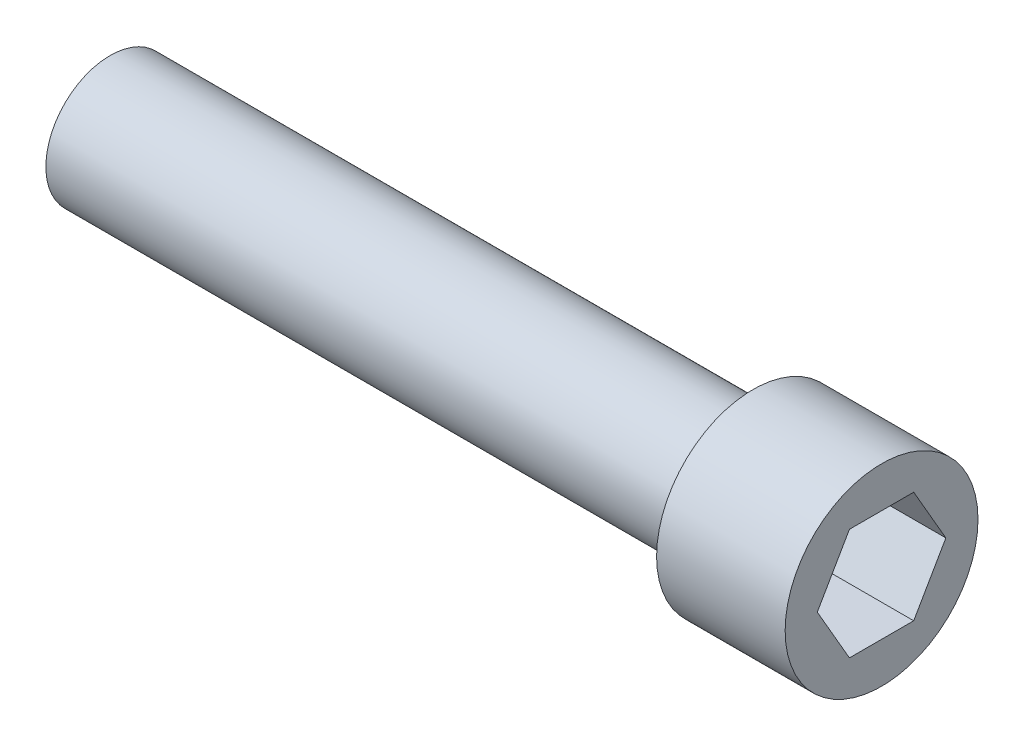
ISO-10303-21;
HEADER;
FILE_DESCRIPTION(('STEP AP214'),'2;1');
FILE_NAME('part.step','',(''),(''),'','','');
FILE_SCHEMA(('AUTOMOTIVE_DESIGN { 1 0 10303 214 1 1 1 1 }'));
ENDSEC;
DATA;
#1=APPLICATION_CONTEXT('core data for automotive mechanical design processes');
#2=APPLICATION_PROTOCOL_DEFINITION('international standard','automotive_design',2000,#1);
#3=PRODUCT_CONTEXT('',#1,'mechanical');
#4=PRODUCT('Part','Part','',(#3));
#5=PRODUCT_RELATED_PRODUCT_CATEGORY('part','',(#4));
#6=PRODUCT_DEFINITION_FORMATION('','',#4);
#7=PRODUCT_DEFINITION_CONTEXT('part definition',#1,'design');
#8=PRODUCT_DEFINITION('design','',#6,#7);
#9=PRODUCT_DEFINITION_SHAPE('','',#8);
#10=(LENGTH_UNIT() NAMED_UNIT(*) SI_UNIT(.MILLI.,.METRE.));
#11=(NAMED_UNIT(*) PLANE_ANGLE_UNIT() SI_UNIT($,.RADIAN.));
#12=(NAMED_UNIT(*) SI_UNIT($,.STERADIAN.) SOLID_ANGLE_UNIT());
#13=UNCERTAINTY_MEASURE_WITH_UNIT(LENGTH_MEASURE(1.E-05),#10,'distance_accuracy_value','');
#14=(GEOMETRIC_REPRESENTATION_CONTEXT(3) GLOBAL_UNCERTAINTY_ASSIGNED_CONTEXT((#13)) GLOBAL_UNIT_ASSIGNED_CONTEXT((#10,
#11,#12)) REPRESENTATION_CONTEXT('',''));
#15=CARTESIAN_POINT('',(0.,0.,0.));
#16=DIRECTION('',(0.,0.,1.));
#17=DIRECTION('',(1.,0.,0.));
#18=AXIS2_PLACEMENT_3D('',#15,#16,#17);
#19=CARTESIAN_POINT('',(10.,0.,0.));
#20=DIRECTION('',(-1.,0.,0.));
#21=DIRECTION('',(0.,0.,1.));
#22=AXIS2_PLACEMENT_3D('',#19,#20,#21);
#23=CYLINDRICAL_SURFACE('',#22,1.);
#24=CARTESIAN_POINT('',(10.,0.,0.));
#25=DIRECTION('',(1.,0.,0.));
#26=DIRECTION('',(0.,0.,-1.));
#27=AXIS2_PLACEMENT_3D('',#24,#25,#26);
#28=CIRCLE('',#27,1.);
#29=CARTESIAN_POINT('',(10.,0.,-1.));
#30=VERTEX_POINT('',#29);
#31=EDGE_CURVE('E11',#30,#30,#28,.T.);
#32=ORIENTED_EDGE('',*,*,#31,.F.);
#33=EDGE_LOOP('',(#32));
#34=FACE_BOUND('',#33,.T.);
#35=CARTESIAN_POINT('',(0.,0.,0.));
#36=DIRECTION('',(1.,0.,0.));
#37=DIRECTION('',(0.,0.,-1.));
#38=AXIS2_PLACEMENT_3D('',#35,#36,#37);
#39=CIRCLE('',#38,1.);
#40=CARTESIAN_POINT('',(0.,0.,-1.));
#41=VERTEX_POINT('',#40);
#42=EDGE_CURVE('E48',#41,#41,#39,.T.);
#43=ORIENTED_EDGE('',*,*,#42,.T.);
#44=EDGE_LOOP('',(#43));
#45=FACE_BOUND('',#44,.T.);
#46=ADVANCED_FACE('F45',(#34,#45),#23,.T.);
#47=CARTESIAN_POINT('',(0.,0.,0.));
#48=DIRECTION('',(1.,0.,0.));
#49=DIRECTION('',(0.,0.,-1.));
#50=AXIS2_PLACEMENT_3D('',#47,#48,#49);
#51=PLANE('',#50);
#52=ORIENTED_EDGE('',*,*,#42,.F.);
#53=EDGE_LOOP('',(#52));
#54=FACE_BOUND('',#53,.T.);
#55=ADVANCED_FACE('F196',(#54),#51,.F.);
#56=CARTESIAN_POINT('',(12.,0.,0.));
#57=DIRECTION('',(-1.,0.,0.));
#58=DIRECTION('',(0.,0.,1.));
#59=AXIS2_PLACEMENT_3D('',#56,#57,#58);
#60=CYLINDRICAL_SURFACE('',#59,1.5);
#61=CARTESIAN_POINT('',(12.,0.,0.));
#62=DIRECTION('',(1.,0.,0.));
#63=DIRECTION('',(0.,0.,-1.));
#64=AXIS2_PLACEMENT_3D('',#61,#62,#63);
#65=CIRCLE('',#64,1.5);
#66=CARTESIAN_POINT('',(12.,0.,-1.5));
#67=VERTEX_POINT('',#66);
#68=EDGE_CURVE('E169',#67,#67,#65,.T.);
#69=ORIENTED_EDGE('',*,*,#68,.F.);
#70=EDGE_LOOP('',(#69));
#71=FACE_BOUND('',#70,.T.);
#72=CARTESIAN_POINT('',(10.,0.,0.));
#73=DIRECTION('',(1.,0.,0.));
#74=DIRECTION('',(0.,0.,-1.));
#75=AXIS2_PLACEMENT_3D('',#72,#73,#74);
#76=CIRCLE('',#75,1.5);
#77=CARTESIAN_POINT('',(10.,0.,-1.5));
#78=VERTEX_POINT('',#77);
#79=EDGE_CURVE('E159',#78,#78,#76,.T.);
#80=ORIENTED_EDGE('',*,*,#79,.T.);
#81=EDGE_LOOP('',(#80));
#82=FACE_BOUND('',#81,.T.);
#83=ADVANCED_FACE('F177',(#71,#82),#60,.T.);
#84=CARTESIAN_POINT('',(12.,0.,0.));
#85=DIRECTION('',(1.,0.,0.));
#86=DIRECTION('',(0.,0.,-1.));
#87=AXIS2_PLACEMENT_3D('',#84,#85,#86);
#88=PLANE('',#87);
#89=DIRECTION('',(0.,-0.866025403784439,0.5));
#90=VECTOR('',#89,1.);
#91=CARTESIAN_POINT('',(12.,0.866025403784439,0.5));
#92=LINE('',#91,#90);
#93=CARTESIAN_POINT('',(12.,0.866025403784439,0.5));
#94=VERTEX_POINT('',#93);
#95=CARTESIAN_POINT('',(12.,0.,1.));
#96=VERTEX_POINT('',#95);
#97=EDGE_CURVE('E60',#94,#96,#92,.T.);
#98=ORIENTED_EDGE('',*,*,#97,.F.);
#99=DIRECTION('',(0.,0.,1.));
#100=VECTOR('',#99,1.);
#101=CARTESIAN_POINT('',(12.,0.866025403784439,-0.5));
#102=LINE('',#101,#100);
#103=CARTESIAN_POINT('',(12.,0.866025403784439,-0.5));
#104=VERTEX_POINT('',#103);
#105=EDGE_CURVE('E153',#104,#94,#102,.T.);
#106=ORIENTED_EDGE('',*,*,#105,.F.);
#107=DIRECTION('',(0.,0.866025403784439,0.5));
#108=VECTOR('',#107,1.);
#109=CARTESIAN_POINT('',(12.,0.,-1.));
#110=LINE('',#109,#108);
#111=CARTESIAN_POINT('',(12.,0.,-1.));
#112=VERTEX_POINT('',#111);
#113=EDGE_CURVE('E150',#112,#104,#110,.T.);
#114=ORIENTED_EDGE('',*,*,#113,.F.);
#115=DIRECTION('',(0.,0.866025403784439,-0.5));
#116=VECTOR('',#115,1.);
#117=CARTESIAN_POINT('',(12.,-0.866025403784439,-0.5));
#118=LINE('',#117,#116);
#119=CARTESIAN_POINT('',(12.,-0.866025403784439,-0.5));
#120=VERTEX_POINT('',#119);
#121=EDGE_CURVE('E108',#120,#112,#118,.T.);
#122=ORIENTED_EDGE('',*,*,#121,.F.);
#123=DIRECTION('',(0.,0.,-1.));
#124=VECTOR('',#123,1.);
#125=CARTESIAN_POINT('',(12.,-0.866025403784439,0.5));
#126=LINE('',#125,#124);
#127=CARTESIAN_POINT('',(12.,-0.866025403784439,0.5));
#128=VERTEX_POINT('',#127);
#129=EDGE_CURVE('E144',#128,#120,#126,.T.);
#130=ORIENTED_EDGE('',*,*,#129,.F.);
#131=DIRECTION('',(0.,-0.866025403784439,-0.5));
#132=VECTOR('',#131,1.);
#133=CARTESIAN_POINT('',(12.,0.,1.));
#134=LINE('',#133,#132);
#135=EDGE_CURVE('E140',#96,#128,#134,.T.);
#136=ORIENTED_EDGE('',*,*,#135,.F.);
#137=EDGE_LOOP('',(#98,#106,#114,#122,#130,#136));
#138=FACE_BOUND('',#137,.T.);
#139=ORIENTED_EDGE('',*,*,#68,.T.);
#140=EDGE_LOOP('',(#139));
#141=FACE_BOUND('',#140,.T.);
#142=ADVANCED_FACE('F182',(#138,#141),#88,.T.);
#143=CARTESIAN_POINT('',(10.,0.,0.));
#144=DIRECTION('',(1.,0.,0.));
#145=DIRECTION('',(0.,0.,-1.));
#146=AXIS2_PLACEMENT_3D('',#143,#144,#145);
#147=PLANE('',#146);
#148=ORIENTED_EDGE('',*,*,#31,.T.);
#149=EDGE_LOOP('',(#148));
#150=FACE_BOUND('',#149,.T.);
#151=ORIENTED_EDGE('',*,*,#79,.F.);
#152=EDGE_LOOP('',(#151));
#153=FACE_BOUND('',#152,.T.);
#154=ADVANCED_FACE('F179',(#150,#153),#147,.F.);
#155=CARTESIAN_POINT('',(10.5,0.866025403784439,0.5));
#156=DIRECTION('',(0.,0.5,0.866025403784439));
#157=DIRECTION('',(0.,-0.866025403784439,0.5));
#158=AXIS2_PLACEMENT_3D('',#155,#156,#157);
#159=PLANE('',#158);
#160=ORIENTED_EDGE('',*,*,#97,.T.);
#161=DIRECTION('',(1.,0.,0.));
#162=VECTOR('',#161,1.);
#163=CARTESIAN_POINT('',(10.5,0.,1.));
#164=LINE('',#163,#162);
#165=CARTESIAN_POINT('',(10.5,0.,1.));
#166=VERTEX_POINT('',#165);
#167=EDGE_CURVE('E90',#166,#96,#164,.T.);
#168=ORIENTED_EDGE('',*,*,#167,.F.);
#169=DIRECTION('',(0.,-0.866025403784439,0.5));
#170=VECTOR('',#169,1.);
#171=CARTESIAN_POINT('',(10.5,0.866025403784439,0.5));
#172=LINE('',#171,#170);
#173=CARTESIAN_POINT('',(10.5,0.866025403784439,0.5));
#174=VERTEX_POINT('',#173);
#175=EDGE_CURVE('E156',#174,#166,#172,.T.);
#176=ORIENTED_EDGE('',*,*,#175,.F.);
#177=DIRECTION('',(1.,0.,0.));
#178=VECTOR('',#177,1.);
#179=CARTESIAN_POINT('',(10.5,0.866025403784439,0.5));
#180=LINE('',#179,#178);
#181=EDGE_CURVE('E68',#174,#94,#180,.T.);
#182=ORIENTED_EDGE('',*,*,#181,.T.);
#183=EDGE_LOOP('',(#160,#168,#176,#182));
#184=FACE_BOUND('',#183,.T.);
#185=ADVANCED_FACE('F181',(#184),#159,.F.);
#186=CARTESIAN_POINT('',(10.5,0.866025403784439,-0.5));
#187=DIRECTION('',(0.,1.,0.));
#188=DIRECTION('',(0.,0.,1.));
#189=AXIS2_PLACEMENT_3D('',#186,#187,#188);
#190=PLANE('',#189);
#191=ORIENTED_EDGE('',*,*,#105,.T.);
#192=ORIENTED_EDGE('',*,*,#181,.F.);
#193=DIRECTION('',(0.,0.,1.));
#194=VECTOR('',#193,1.);
#195=CARTESIAN_POINT('',(10.5,0.866025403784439,-0.5));
#196=LINE('',#195,#194);
#197=CARTESIAN_POINT('',(10.5,0.866025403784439,-0.5));
#198=VERTEX_POINT('',#197);
#199=EDGE_CURVE('E122',#198,#174,#196,.T.);
#200=ORIENTED_EDGE('',*,*,#199,.F.);
#201=DIRECTION('',(1.,0.,0.));
#202=VECTOR('',#201,1.);
#203=CARTESIAN_POINT('',(10.5,0.866025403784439,-0.5));
#204=LINE('',#203,#202);
#205=EDGE_CURVE('E113',#198,#104,#204,.T.);
#206=ORIENTED_EDGE('',*,*,#205,.T.);
#207=EDGE_LOOP('',(#191,#192,#200,#206));
#208=FACE_BOUND('',#207,.T.);
#209=ADVANCED_FACE('F190',(#208),#190,.F.);
#210=CARTESIAN_POINT('',(10.5,0.,-1.));
#211=DIRECTION('',(0.,0.5,-0.866025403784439));
#212=DIRECTION('',(0.,0.866025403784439,0.5));
#213=AXIS2_PLACEMENT_3D('',#210,#211,#212);
#214=PLANE('',#213);
#215=ORIENTED_EDGE('',*,*,#113,.T.);
#216=ORIENTED_EDGE('',*,*,#205,.F.);
#217=DIRECTION('',(0.,0.866025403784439,0.5));
#218=VECTOR('',#217,1.);
#219=CARTESIAN_POINT('',(10.5,0.,-1.));
#220=LINE('',#219,#218);
#221=CARTESIAN_POINT('',(10.5,0.,-1.));
#222=VERTEX_POINT('',#221);
#223=EDGE_CURVE('E117',#222,#198,#220,.T.);
#224=ORIENTED_EDGE('',*,*,#223,.F.);
#225=DIRECTION('',(1.,0.,0.));
#226=VECTOR('',#225,1.);
#227=CARTESIAN_POINT('',(10.5,0.,-1.));
#228=LINE('',#227,#226);
#229=EDGE_CURVE('E101',#222,#112,#228,.T.);
#230=ORIENTED_EDGE('',*,*,#229,.T.);
#231=EDGE_LOOP('',(#215,#216,#224,#230));
#232=FACE_BOUND('',#231,.T.);
#233=ADVANCED_FACE('F118',(#232),#214,.F.);
#234=CARTESIAN_POINT('',(10.5,-0.866025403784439,-0.5));
#235=DIRECTION('',(0.,-0.5,-0.866025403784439));
#236=DIRECTION('',(0.,0.866025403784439,-0.5));
#237=AXIS2_PLACEMENT_3D('',#234,#235,#236);
#238=PLANE('',#237);
#239=ORIENTED_EDGE('',*,*,#121,.T.);
#240=ORIENTED_EDGE('',*,*,#229,.F.);
#241=DIRECTION('',(0.,0.866025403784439,-0.5));
#242=VECTOR('',#241,1.);
#243=CARTESIAN_POINT('',(10.5,-0.866025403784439,-0.5));
#244=LINE('',#243,#242);
#245=CARTESIAN_POINT('',(10.5,-0.866025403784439,-0.5));
#246=VERTEX_POINT('',#245);
#247=EDGE_CURVE('E105',#246,#222,#244,.T.);
#248=ORIENTED_EDGE('',*,*,#247,.F.);
#249=DIRECTION('',(1.,0.,0.));
#250=VECTOR('',#249,1.);
#251=CARTESIAN_POINT('',(10.5,-0.866025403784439,-0.5));
#252=LINE('',#251,#250);
#253=EDGE_CURVE('E114',#246,#120,#252,.T.);
#254=ORIENTED_EDGE('',*,*,#253,.T.);
#255=EDGE_LOOP('',(#239,#240,#248,#254));
#256=FACE_BOUND('',#255,.T.);
#257=ADVANCED_FACE('F103',(#256),#238,.F.);
#258=CARTESIAN_POINT('',(10.5,-0.866025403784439,0.5));
#259=DIRECTION('',(0.,-1.,0.));
#260=DIRECTION('',(0.,0.,-1.));
#261=AXIS2_PLACEMENT_3D('',#258,#259,#260);
#262=PLANE('',#261);
#263=ORIENTED_EDGE('',*,*,#129,.T.);
#264=ORIENTED_EDGE('',*,*,#253,.F.);
#265=DIRECTION('',(0.,0.,-1.));
#266=VECTOR('',#265,1.);
#267=CARTESIAN_POINT('',(10.5,-0.866025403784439,0.5));
#268=LINE('',#267,#266);
#269=CARTESIAN_POINT('',(10.5,-0.866025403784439,0.5));
#270=VERTEX_POINT('',#269);
#271=EDGE_CURVE('E128',#270,#246,#268,.T.);
#272=ORIENTED_EDGE('',*,*,#271,.F.);
#273=DIRECTION('',(1.,0.,0.));
#274=VECTOR('',#273,1.);
#275=CARTESIAN_POINT('',(10.5,-0.866025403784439,0.5));
#276=LINE('',#275,#274);
#277=EDGE_CURVE('E164',#270,#128,#276,.T.);
#278=ORIENTED_EDGE('',*,*,#277,.T.);
#279=EDGE_LOOP('',(#263,#264,#272,#278));
#280=FACE_BOUND('',#279,.T.);
#281=ADVANCED_FACE('F259',(#280),#262,.F.);
#282=CARTESIAN_POINT('',(10.5,0.,1.));
#283=DIRECTION('',(0.,-0.5,0.866025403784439));
#284=DIRECTION('',(0.,-0.866025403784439,-0.5));
#285=AXIS2_PLACEMENT_3D('',#282,#283,#284);
#286=PLANE('',#285);
#287=ORIENTED_EDGE('',*,*,#135,.T.);
#288=ORIENTED_EDGE('',*,*,#277,.F.);
#289=DIRECTION('',(0.,-0.866025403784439,-0.5));
#290=VECTOR('',#289,1.);
#291=CARTESIAN_POINT('',(10.5,0.,1.));
#292=LINE('',#291,#290);
#293=EDGE_CURVE('E132',#166,#270,#292,.T.);
#294=ORIENTED_EDGE('',*,*,#293,.F.);
#295=ORIENTED_EDGE('',*,*,#167,.T.);
#296=EDGE_LOOP('',(#287,#288,#294,#295));
#297=FACE_BOUND('',#296,.T.);
#298=ADVANCED_FACE('F268',(#297),#286,.F.);
#299=CARTESIAN_POINT('',(10.5,0.,0.));
#300=DIRECTION('',(1.,0.,0.));
#301=DIRECTION('',(0.,0.,-1.));
#302=AXIS2_PLACEMENT_3D('',#299,#300,#301);
#303=PLANE('',#302);
#304=ORIENTED_EDGE('',*,*,#175,.T.);
#305=ORIENTED_EDGE('',*,*,#293,.T.);
#306=ORIENTED_EDGE('',*,*,#271,.T.);
#307=ORIENTED_EDGE('',*,*,#247,.T.);
#308=ORIENTED_EDGE('',*,*,#223,.T.);
#309=ORIENTED_EDGE('',*,*,#199,.T.);
#310=EDGE_LOOP('',(#304,#305,#306,#307,#308,#309));
#311=FACE_BOUND('',#310,.T.);
#312=ADVANCED_FACE('F125',(#311),#303,.T.);
#313=CLOSED_SHELL('',(#46,#55,#83,#142,#154,#185,#209,#233,#257,#281,#298,#312));
#314=MANIFOLD_SOLID_BREP('B2',#313);
#315=ADVANCED_BREP_SHAPE_REPRESENTATION('',(#18,#314),#14);
#316=SHAPE_DEFINITION_REPRESENTATION(#9,#315);
ENDSEC;
END-ISO-10303-21;
